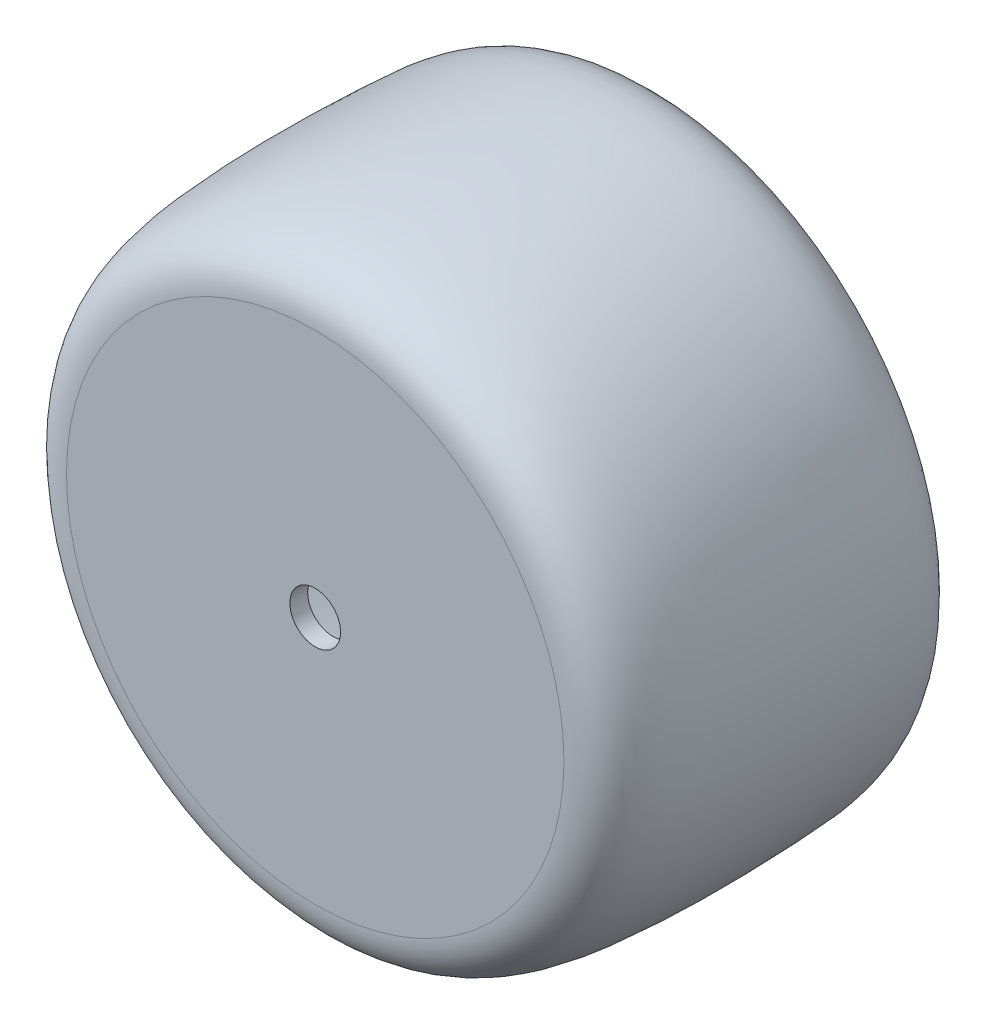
ISO-10303-21;
HEADER;
FILE_DESCRIPTION(('STEP AP214'),'2;1');
FILE_NAME('part.step','',(''),(''),'','','');
FILE_SCHEMA(('AUTOMOTIVE_DESIGN { 1 0 10303 214 1 1 1 1 }'));
ENDSEC;
DATA;
#1=APPLICATION_CONTEXT('core data for automotive mechanical design processes');
#2=APPLICATION_PROTOCOL_DEFINITION('international standard','automotive_design',2000,#1);
#3=PRODUCT_CONTEXT('',#1,'mechanical');
#4=PRODUCT('Part','Part','',(#3));
#5=PRODUCT_RELATED_PRODUCT_CATEGORY('part','',(#4));
#6=PRODUCT_DEFINITION_FORMATION('','',#4);
#7=PRODUCT_DEFINITION_CONTEXT('part definition',#1,'design');
#8=PRODUCT_DEFINITION('design','',#6,#7);
#9=PRODUCT_DEFINITION_SHAPE('','',#8);
#10=(LENGTH_UNIT() NAMED_UNIT(*) SI_UNIT(.MILLI.,.METRE.));
#11=(NAMED_UNIT(*) PLANE_ANGLE_UNIT() SI_UNIT($,.RADIAN.));
#12=(NAMED_UNIT(*) SI_UNIT($,.STERADIAN.) SOLID_ANGLE_UNIT());
#13=UNCERTAINTY_MEASURE_WITH_UNIT(LENGTH_MEASURE(1.E-05),#10,'distance_accuracy_value','');
#14=(GEOMETRIC_REPRESENTATION_CONTEXT(3) GLOBAL_UNCERTAINTY_ASSIGNED_CONTEXT((#13)) GLOBAL_UNIT_ASSIGNED_CONTEXT((#10,
#11,#12)) REPRESENTATION_CONTEXT('',''));
#15=CARTESIAN_POINT('',(0.,0.,0.));
#16=DIRECTION('',(0.,0.,1.));
#17=DIRECTION('',(1.,0.,0.));
#18=AXIS2_PLACEMENT_3D('',#15,#16,#17);
#19=CARTESIAN_POINT('',(-95.,-9.37611806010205E-13,516.903740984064));
#20=CARTESIAN_POINT('',(-95.,-9.37611806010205E-13,567.751629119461));
#21=CARTESIAN_POINT('',(-94.9999999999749,-10.0000000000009,516.903740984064));
#22=CARTESIAN_POINT('',(-94.9999999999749,-10.0000000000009,567.751629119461));
#23=CARTESIAN_POINT('',(-105.,-10.0000000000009,516.903740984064));
#24=CARTESIAN_POINT('',(-105.,-10.0000000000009,567.751629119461));
#25=CARTESIAN_POINT('',(-114.999999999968,-10.0000000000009,516.903740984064));
#26=CARTESIAN_POINT('',(-114.999999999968,-10.0000000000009,567.751629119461));
#27=CARTESIAN_POINT('',(-115.,-9.38836452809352E-13,516.903740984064));
#28=CARTESIAN_POINT('',(-115.,-9.38836452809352E-13,567.751629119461));
#29=CARTESIAN_POINT('',(-114.999999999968,9.99999999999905,516.903740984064));
#30=CARTESIAN_POINT('',(-114.999999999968,9.99999999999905,567.751629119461));
#31=CARTESIAN_POINT('',(-105.,9.99999999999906,516.903740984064));
#32=CARTESIAN_POINT('',(-105.,9.99999999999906,567.751629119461));
#33=CARTESIAN_POINT('',(-94.9999999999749,9.99999999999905,516.903740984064));
#34=CARTESIAN_POINT('',(-94.9999999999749,9.99999999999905,567.751629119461));
#35=CARTESIAN_POINT('',(-95.,-9.37611806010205E-13,516.903740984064));
#36=CARTESIAN_POINT('',(-95.,-9.37611806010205E-13,567.751629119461));
#37=(BOUNDED_SURFACE() B_SPLINE_SURFACE(2,1,((#19,#20),(#21,#22),(#23,#24),(#25,#26),(#27,#28),
(#29,#30),(#31,#32),(#33,#34),(#35,#36)),.UNSPECIFIED.,.T.,.F.,
.F.) B_SPLINE_SURFACE_WITH_KNOTS((3,2,2,2,3),(2,2),(0.,15.7079632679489,31.415926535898,
47.1238898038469,62.8318530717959),(0.,8.65537010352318),
.UNSPECIFIED.) GEOMETRIC_REPRESENTATION_ITEM() RATIONAL_B_SPLINE_SURFACE(((1.,1.),
(0.707106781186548,0.707106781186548),(1.,1.),(0.707106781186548,0.707106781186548),(1.,1.),
(0.707106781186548,0.707106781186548),(1.,1.),(0.707106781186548,0.707106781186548),(1.,1.))) REPRESENTATION_ITEM('') SURFACE());
#38=CARTESIAN_POINT('',(-115.,-9.37840606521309E-13,538.));
#39=CARTESIAN_POINT('',(-115.,9.99999999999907,538.));
#40=CARTESIAN_POINT('',(-105.,9.99999999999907,538.));
#41=CARTESIAN_POINT('',(-94.9999999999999,9.99999999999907,538.));
#42=CARTESIAN_POINT('',(-95.,-9.36158358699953E-13,538.));
#43=CARTESIAN_POINT('',(-94.9999999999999,-10.0000000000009,538.));
#44=CARTESIAN_POINT('',(-105.,-10.0000000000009,538.));
#45=CARTESIAN_POINT('',(-115.,-10.0000000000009,538.));
#46=CARTESIAN_POINT('',(-115.,-9.37840606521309E-13,538.));
#47=(BOUNDED_CURVE() B_SPLINE_CURVE(2,(#38,#39,#40,#41,#42,#43,#44,#45,#46),.UNSPECIFIED.,.T.,
.F.) B_SPLINE_CURVE_WITH_KNOTS((3,2,2,2,3),(0.,191.105053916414,382.210107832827,
573.31516174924,764.420215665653),
.UNSPECIFIED.) CURVE() GEOMETRIC_REPRESENTATION_ITEM() RATIONAL_B_SPLINE_CURVE((1.,
0.707106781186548,1.,0.707106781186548,1.,0.707106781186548,1.,0.707106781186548,1.)) REPRESENTATION_ITEM(''));
#48=CARTESIAN_POINT('',(-95.,-9.37127323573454E-13,538.));
#49=VERTEX_POINT('',#48);
#50=CARTESIAN_POINT('',(-115.,-8.28310601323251E-13,538.));
#51=VERTEX_POINT('',#50);
#52=EDGE_CURVE('E40',#49,#51,#47,.T.);
#53=CARTESIAN_POINT('',(-115.,-9.37840606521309E-13,538.));
#54=CARTESIAN_POINT('',(-115.,9.99999999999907,538.));
#55=CARTESIAN_POINT('',(-105.,9.99999999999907,538.));
#56=CARTESIAN_POINT('',(-94.9999999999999,9.99999999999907,538.));
#57=CARTESIAN_POINT('',(-95.,-9.36158358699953E-13,538.));
#58=CARTESIAN_POINT('',(-94.9999999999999,-10.0000000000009,538.));
#59=CARTESIAN_POINT('',(-105.,-10.0000000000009,538.));
#60=CARTESIAN_POINT('',(-115.,-10.0000000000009,538.));
#61=CARTESIAN_POINT('',(-115.,-9.37840606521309E-13,538.));
#62=(BOUNDED_CURVE() B_SPLINE_CURVE(2,(#53,#54,#55,#56,#57,#58,#59,#60,#61),.UNSPECIFIED.,.T.,
.F.) B_SPLINE_CURVE_WITH_KNOTS((3,2,2,2,3),(0.,191.105053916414,382.210107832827,
573.31516174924,764.420215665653),
.UNSPECIFIED.) CURVE() GEOMETRIC_REPRESENTATION_ITEM() RATIONAL_B_SPLINE_CURVE((1.,
0.707106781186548,1.,0.707106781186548,1.,0.707106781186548,1.,0.707106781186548,1.)) REPRESENTATION_ITEM(''));
#63=EDGE_CURVE('E61',#51,#49,#62,.T.);
#64=CARTESIAN_POINT('',(-115.,-9.35138232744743E-13,531.000032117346));
#65=CARTESIAN_POINT('',(-115.,-10.0000000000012,531.000032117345));
#66=CARTESIAN_POINT('',(-105.,-10.0000000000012,531.000032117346));
#67=CARTESIAN_POINT('',(-94.9999999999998,-10.0000000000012,531.000032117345));
#68=CARTESIAN_POINT('',(-94.9999999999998,-9.3886073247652E-13,531.000032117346));
#69=CARTESIAN_POINT('',(-94.9999999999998,9.99999999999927,531.000032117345));
#70=CARTESIAN_POINT('',(-105.,9.99999999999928,531.000032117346));
#71=CARTESIAN_POINT('',(-115.,9.99999999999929,531.000032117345));
#72=CARTESIAN_POINT('',(-115.,-9.35138232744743E-13,531.000032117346));
#73=(BOUNDED_CURVE() B_SPLINE_CURVE(2,(#64,#65,#66,#67,#68,#69,#70,#71,#72),.UNSPECIFIED.,.T.,
.F.) B_SPLINE_CURVE_WITH_KNOTS((3,2,2,2,3),(0.,191.105053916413,382.210107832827,
573.315161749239,764.420215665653),
.UNSPECIFIED.) CURVE() GEOMETRIC_REPRESENTATION_ITEM() RATIONAL_B_SPLINE_CURVE((1.,
0.707106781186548,1.,0.707106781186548,1.,0.707106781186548,1.,0.707106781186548,1.)) REPRESENTATION_ITEM(''));
#74=CARTESIAN_POINT('',(-95.,-9.3802811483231E-13,531.000032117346));
#75=VERTEX_POINT('',#74);
#76=CARTESIAN_POINT('',(-114.99999999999,-9.36370972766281E-13,531.000032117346));
#77=VERTEX_POINT('',#76);
#78=EDGE_CURVE('E48',#75,#77,#73,.T.);
#79=CARTESIAN_POINT('',(-114.999999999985,-9.35138232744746E-13,531.000032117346));
#80=CARTESIAN_POINT('',(-114.999999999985,-9.99999999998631,531.000032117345));
#81=CARTESIAN_POINT('',(-105.,-9.99999999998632,531.000032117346));
#82=CARTESIAN_POINT('',(-95.0000000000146,-9.99999999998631,531.000032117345));
#83=CARTESIAN_POINT('',(-95.0000000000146,-9.38860732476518E-13,531.000032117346));
#84=CARTESIAN_POINT('',(-95.0000000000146,9.99999999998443,531.000032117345));
#85=CARTESIAN_POINT('',(-105.,9.99999999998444,531.000032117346));
#86=CARTESIAN_POINT('',(-114.999999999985,9.99999999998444,531.000032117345));
#87=CARTESIAN_POINT('',(-114.999999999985,-9.35138232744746E-13,531.000032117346));
#88=(BOUNDED_CURVE() B_SPLINE_CURVE(2,(#79,#80,#81,#82,#83,#84,#85,#86,#87),.UNSPECIFIED.,.T.,
.F.) B_SPLINE_CURVE_WITH_KNOTS((3,2,2,2,3),(0.,191.105053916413,382.210107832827,
573.315161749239,764.420215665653),
.UNSPECIFIED.) CURVE() GEOMETRIC_REPRESENTATION_ITEM() RATIONAL_B_SPLINE_CURVE((1.,
0.707106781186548,1.,0.707106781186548,1.,0.707106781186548,1.,0.707106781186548,1.)) REPRESENTATION_ITEM(''));
#89=EDGE_CURVE('E51',#77,#75,#88,.T.);
#90=ORIENTED_EDGE('',*,*,#52,.F.);
#91=ORIENTED_EDGE('',*,*,#63,.F.);
#92=EDGE_LOOP('',(#90,#91));
#93=FACE_BOUND('',#92,.T.);
#94=ORIENTED_EDGE('',*,*,#78,.F.);
#95=ORIENTED_EDGE('',*,*,#89,.F.);
#96=EDGE_LOOP('',(#94,#95));
#97=FACE_BOUND('',#96,.T.);
#98=ADVANCED_FACE('F18',(#93,#97),#37,.T.);
#99=CARTESIAN_POINT('',(-114.999999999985,-9.35138232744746E-13,531.000032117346));
#100=CARTESIAN_POINT('',(-114.999999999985,9.99999999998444,531.000032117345));
#101=CARTESIAN_POINT('',(-105.,9.99999999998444,531.000032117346));
#102=CARTESIAN_POINT('',(-95.0000000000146,9.99999999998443,531.000032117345));
#103=CARTESIAN_POINT('',(-95.0000000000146,-9.38860732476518E-13,531.000032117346));
#104=CARTESIAN_POINT('',(-95.0000000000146,-9.99999999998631,531.000032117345));
#105=CARTESIAN_POINT('',(-105.,-9.99999999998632,531.000032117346));
#106=CARTESIAN_POINT('',(-114.999999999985,-9.99999999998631,531.000032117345));
#107=CARTESIAN_POINT('',(-114.999999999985,-9.35138232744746E-13,531.000032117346));
#108=CARTESIAN_POINT('',(-144.232099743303,-9.28978880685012E-13,531.000126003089));
#109=CARTESIAN_POINT('',(-144.232099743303,39.2320997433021,531.000126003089));
#110=CARTESIAN_POINT('',(-105.,39.2320997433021,531.000126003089));
#111=CARTESIAN_POINT('',(-65.7679002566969,39.2320997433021,531.000126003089));
#112=CARTESIAN_POINT('',(-65.7679002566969,-9.4144018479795E-13,531.000126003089));
#113=CARTESIAN_POINT('',(-65.7679002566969,-39.232099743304,531.000126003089));
#114=CARTESIAN_POINT('',(-105.,-39.232099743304,531.000126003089));
#115=CARTESIAN_POINT('',(-144.232099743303,-39.232099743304,531.000126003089));
#116=CARTESIAN_POINT('',(-144.232099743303,-9.28978880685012E-13,531.000126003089));
#117=CARTESIAN_POINT('',(-173.46419948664,-9.31871440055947E-13,531.000219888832));
#118=CARTESIAN_POINT('',(-173.464199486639,68.4641994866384,531.000219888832));
#119=CARTESIAN_POINT('',(-105.,68.4641994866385,531.000219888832));
#120=CARTESIAN_POINT('',(-36.5358005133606,68.4641994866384,531.000219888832));
#121=CARTESIAN_POINT('',(-36.5358005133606,-9.34967725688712E-13,531.000219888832));
#122=CARTESIAN_POINT('',(-36.5358005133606,-68.4641994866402,531.000219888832));
#123=CARTESIAN_POINT('',(-105.,-68.4641994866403,531.000219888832));
#124=CARTESIAN_POINT('',(-173.464199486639,-68.4641994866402,531.000219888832));
#125=CARTESIAN_POINT('',(-173.46419948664,-9.31871440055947E-13,531.000219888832));
#126=CARTESIAN_POINT('',(-202.696299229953,-9.34763999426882E-13,531.000313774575));
#127=CARTESIAN_POINT('',(-202.696299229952,97.6962992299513,531.000313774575));
#128=CARTESIAN_POINT('',(-105.,97.6962992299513,531.000313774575));
#129=CARTESIAN_POINT('',(-7.30370077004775,97.6962992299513,531.000313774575));
#130=CARTESIAN_POINT('',(-7.30370077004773,-9.28495266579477E-13,531.000313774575));
#131=CARTESIAN_POINT('',(-7.30370077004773,-97.6962992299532,531.000313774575));
#132=CARTESIAN_POINT('',(-105.,-97.6962992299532,531.000313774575));
#133=CARTESIAN_POINT('',(-202.696299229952,-97.6962992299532,531.000313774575));
#134=CARTESIAN_POINT('',(-202.696299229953,-9.34763999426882E-13,531.000313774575));
#135=(BOUNDED_SURFACE() B_SPLINE_SURFACE(3,2,((#99,#100,#101,#102,#103,#104,#105,#106,#107),
(#108,#109,#110,#111,#112,#113,#114,#115,#116),(#117,#118,#119,#120,#121,#122,#123,#124,#125),
(#126,#127,#128,#129,#130,#131,#132,#133,#134)),.UNSPECIFIED.,.F.,.T.,
.F.) B_SPLINE_SURFACE_WITH_KNOTS((4,4),(3,2,2,2,3),(-499.545143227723,-328.174876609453),(0.,
191.105053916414,382.210107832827,573.31516174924,764.420215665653),
.UNSPECIFIED.) GEOMETRIC_REPRESENTATION_ITEM() RATIONAL_B_SPLINE_SURFACE(((1.,0.707106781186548,
1.,0.707106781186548,1.,0.707106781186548,1.,0.707106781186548,1.),(1.,0.707106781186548,1.,
0.707106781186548,1.,0.707106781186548,1.,0.707106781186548,1.),(1.,0.707106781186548,1.,
0.707106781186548,1.,0.707106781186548,1.,0.707106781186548,1.),(1.,0.707106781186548,1.,
0.707106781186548,1.,0.707106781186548,1.,0.707106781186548,1.))) REPRESENTATION_ITEM('') SURFACE());
#136=CARTESIAN_POINT('',(-202.696299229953,-9.34763999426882E-13,531.000313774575));
#137=CARTESIAN_POINT('',(-202.696299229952,97.6962992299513,531.000313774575));
#138=CARTESIAN_POINT('',(-105.,97.6962992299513,531.000313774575));
#139=CARTESIAN_POINT('',(-7.30370077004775,97.6962992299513,531.000313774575));
#140=CARTESIAN_POINT('',(-7.30370077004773,-9.28495266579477E-13,531.000313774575));
#141=CARTESIAN_POINT('',(-7.30370077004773,-97.6962992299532,531.000313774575));
#142=CARTESIAN_POINT('',(-105.,-97.6962992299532,531.000313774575));
#143=CARTESIAN_POINT('',(-202.696299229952,-97.6962992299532,531.000313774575));
#144=CARTESIAN_POINT('',(-202.696299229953,-9.34763999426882E-13,531.000313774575));
#145=(BOUNDED_CURVE() B_SPLINE_CURVE(2,(#136,#137,#138,#139,#140,#141,#142,#143,#144),
.UNSPECIFIED.,.T.,.F.) B_SPLINE_CURVE_WITH_KNOTS((3,2,2,2,3),(0.,191.105053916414,
382.210107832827,573.31516174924,764.420215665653),
.UNSPECIFIED.) CURVE() GEOMETRIC_REPRESENTATION_ITEM() RATIONAL_B_SPLINE_CURVE((1.,
0.707106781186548,1.,0.707106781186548,1.,0.707106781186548,1.,0.707106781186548,1.)) REPRESENTATION_ITEM(''));
#146=CARTESIAN_POINT('',(-202.696299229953,-9.34763999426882E-13,531.000313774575));
#147=VERTEX_POINT('',#146);
#148=EDGE_CURVE('E11',#147,#147,#145,.T.);
#149=ORIENTED_EDGE('',*,*,#148,.T.);
#150=EDGE_LOOP('',(#149));
#151=FACE_BOUND('',#150,.T.);
#152=ORIENTED_EDGE('',*,*,#78,.T.);
#153=ORIENTED_EDGE('',*,*,#89,.T.);
#154=EDGE_LOOP('',(#152,#153));
#155=FACE_BOUND('',#154,.T.);
#156=ADVANCED_FACE('F59',(#151,#155),#135,.T.);
#157=CARTESIAN_POINT('',(-202.762577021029,-9.39848618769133E-13,538.));
#158=CARTESIAN_POINT('',(-202.762577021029,97.7625770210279,538.));
#159=CARTESIAN_POINT('',(-105.,97.7625770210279,538.));
#160=CARTESIAN_POINT('',(-7.23742297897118,97.7625770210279,538.));
#161=CARTESIAN_POINT('',(-7.23742297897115,-9.23402530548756E-13,538.));
#162=CARTESIAN_POINT('',(-7.23742297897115,-97.7625770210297,538.));
#163=CARTESIAN_POINT('',(-105.,-97.7625770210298,538.));
#164=CARTESIAN_POINT('',(-202.762577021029,-97.7625770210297,538.));
#165=CARTESIAN_POINT('',(-202.762577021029,-9.39848618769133E-13,538.));
#166=CARTESIAN_POINT('',(-173.508384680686,-9.39179281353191E-13,538.));
#167=CARTESIAN_POINT('',(-173.508384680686,68.5083846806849,538.));
#168=CARTESIAN_POINT('',(-105.,68.508384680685,538.));
#169=CARTESIAN_POINT('',(-36.4916153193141,68.5083846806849,538.));
#170=CARTESIAN_POINT('',(-36.4916153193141,-9.27654473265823E-13,538.));
#171=CARTESIAN_POINT('',(-36.4916153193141,-68.5083846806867,538.));
#172=CARTESIAN_POINT('',(-105.,-68.5083846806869,538.));
#173=CARTESIAN_POINT('',(-173.508384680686,-68.5083846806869,538.));
#174=CARTESIAN_POINT('',(-173.508384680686,-9.39179281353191E-13,538.));
#175=CARTESIAN_POINT('',(-144.254192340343,-9.38509943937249E-13,538.));
#176=CARTESIAN_POINT('',(-144.254192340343,39.254192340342,538.));
#177=CARTESIAN_POINT('',(-105.,39.254192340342,538.));
#178=CARTESIAN_POINT('',(-65.7458076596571,39.254192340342,538.));
#179=CARTESIAN_POINT('',(-65.7458076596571,-9.31906415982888E-13,538.));
#180=CARTESIAN_POINT('',(-65.7458076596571,-39.2541923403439,538.));
#181=CARTESIAN_POINT('',(-105.,-39.2541923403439,538.));
#182=CARTESIAN_POINT('',(-144.254192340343,-39.2541923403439,538.));
#183=CARTESIAN_POINT('',(-144.254192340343,-9.38509943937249E-13,538.));
#184=CARTESIAN_POINT('',(-115.,-9.37840606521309E-13,538.));
#185=CARTESIAN_POINT('',(-115.,9.99999999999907,538.));
#186=CARTESIAN_POINT('',(-105.,9.99999999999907,538.));
#187=CARTESIAN_POINT('',(-94.9999999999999,9.99999999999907,538.));
#188=CARTESIAN_POINT('',(-95.,-9.36158358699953E-13,538.));
#189=CARTESIAN_POINT('',(-94.9999999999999,-10.0000000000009,538.));
#190=CARTESIAN_POINT('',(-105.,-10.0000000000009,538.));
#191=CARTESIAN_POINT('',(-115.,-10.0000000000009,538.));
#192=CARTESIAN_POINT('',(-115.,-9.37840606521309E-13,538.));
#193=(BOUNDED_SURFACE() B_SPLINE_SURFACE(3,2,((#157,#158,#159,#160,#161,#162,#163,#164,#165),
(#166,#167,#168,#169,#170,#171,#172,#173,#174),(#175,#176,#177,#178,#179,#180,#181,#182,#183),
(#184,#185,#186,#187,#188,#189,#190,#191,#192)),.UNSPECIFIED.,.F.,.T.,
.F.) B_SPLINE_SURFACE_WITH_KNOTS((4,4),(3,2,2,2,3),(-183.788922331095,-12.4054077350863),(0.,
191.105053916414,382.210107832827,573.31516174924,764.420215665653),
.UNSPECIFIED.) GEOMETRIC_REPRESENTATION_ITEM() RATIONAL_B_SPLINE_SURFACE(((1.,0.707106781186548,
1.,0.707106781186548,1.,0.707106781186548,1.,0.707106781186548,1.),(1.,0.707106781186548,1.,
0.707106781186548,1.,0.707106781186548,1.,0.707106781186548,1.),(1.,0.707106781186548,1.,
0.707106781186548,1.,0.707106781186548,1.,0.707106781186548,1.),(1.,0.707106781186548,1.,
0.707106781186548,1.,0.707106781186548,1.,0.707106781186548,1.))) REPRESENTATION_ITEM('') SURFACE());
#194=CARTESIAN_POINT('',(-202.762577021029,-9.39848618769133E-13,538.));
#195=CARTESIAN_POINT('',(-202.762577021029,97.7625770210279,538.));
#196=CARTESIAN_POINT('',(-105.,97.7625770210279,538.));
#197=CARTESIAN_POINT('',(-7.23742297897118,97.7625770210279,538.));
#198=CARTESIAN_POINT('',(-7.23742297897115,-9.23402530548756E-13,538.));
#199=CARTESIAN_POINT('',(-7.23742297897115,-97.7625770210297,538.));
#200=CARTESIAN_POINT('',(-105.,-97.7625770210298,538.));
#201=CARTESIAN_POINT('',(-202.762577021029,-97.7625770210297,538.));
#202=CARTESIAN_POINT('',(-202.762577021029,-9.39848618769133E-13,538.));
#203=(BOUNDED_CURVE() B_SPLINE_CURVE(2,(#194,#195,#196,#197,#198,#199,#200,#201,#202),
.UNSPECIFIED.,.T.,.F.) B_SPLINE_CURVE_WITH_KNOTS((3,2,2,2,3),(0.,191.105053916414,
382.210107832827,573.31516174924,764.420215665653),
.UNSPECIFIED.) CURVE() GEOMETRIC_REPRESENTATION_ITEM() RATIONAL_B_SPLINE_CURVE((1.,
0.707106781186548,1.,0.707106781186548,1.,0.707106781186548,1.,0.707106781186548,1.)) REPRESENTATION_ITEM(''));
#204=CARTESIAN_POINT('',(-202.762577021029,-9.39848618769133E-13,538.));
#205=VERTEX_POINT('',#204);
#206=EDGE_CURVE('E32',#205,#205,#203,.T.);
#207=ORIENTED_EDGE('',*,*,#52,.T.);
#208=ORIENTED_EDGE('',*,*,#63,.T.);
#209=EDGE_LOOP('',(#207,#208));
#210=FACE_BOUND('',#209,.T.);
#211=ORIENTED_EDGE('',*,*,#206,.F.);
#212=EDGE_LOOP('',(#211));
#213=FACE_BOUND('',#212,.T.);
#214=ADVANCED_FACE('F81',(#210,#213),#193,.T.);
#215=CARTESIAN_POINT('',(-202.696299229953,-9.34763999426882E-13,531.000313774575));
#216=CARTESIAN_POINT('',(-202.696299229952,97.6962992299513,531.000313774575));
#217=CARTESIAN_POINT('',(-105.,97.6962992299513,531.000313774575));
#218=CARTESIAN_POINT('',(-7.30370077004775,97.6962992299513,531.000313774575));
#219=CARTESIAN_POINT('',(-7.30370077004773,-9.28495266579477E-13,531.000313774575));
#220=CARTESIAN_POINT('',(-7.30370077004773,-97.6962992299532,531.000313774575));
#221=CARTESIAN_POINT('',(-105.,-97.6962992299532,531.000313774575));
#222=CARTESIAN_POINT('',(-202.696299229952,-97.6962992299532,531.000313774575));
#223=CARTESIAN_POINT('',(-202.696299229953,-9.34763999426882E-13,531.000313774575));
#224=CARTESIAN_POINT('',(-209.67450409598,-8.07855926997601E-13,531.11984691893));
#225=CARTESIAN_POINT('',(-209.674504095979,104.674504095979,531.11984691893));
#226=CARTESIAN_POINT('',(-105.,104.674504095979,531.11984691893));
#227=CARTESIAN_POINT('',(-0.3254959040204,104.674504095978,531.11984691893));
#228=CARTESIAN_POINT('',(-0.325495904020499,-1.05454875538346E-12,531.11984691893));
#229=CARTESIAN_POINT('',(-0.325495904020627,-104.67450409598,531.11984691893));
#230=CARTESIAN_POINT('',(-105.,-104.67450409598,531.11984691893));
#231=CARTESIAN_POINT('',(-209.674504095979,-104.67450409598,531.11984691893));
#232=CARTESIAN_POINT('',(-209.67450409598,-8.07855926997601E-13,531.11984691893));
#233=CARTESIAN_POINT('',(-215.842457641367,1.09129879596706E-13,521.418533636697));
#234=CARTESIAN_POINT('',(-215.842457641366,110.842457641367,521.418533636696));
#235=CARTESIAN_POINT('',(-105.,110.842457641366,521.418533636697));
#236=CARTESIAN_POINT('',(5.84245764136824,110.842457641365,521.418533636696));
#237=CARTESIAN_POINT('',(5.84245764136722,-1.9707792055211E-12,521.418533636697));
#238=CARTESIAN_POINT('',(5.84245764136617,-110.842457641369,521.418533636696));
#239=CARTESIAN_POINT('',(-105.,-110.842457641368,521.418533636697));
#240=CARTESIAN_POINT('',(-215.842457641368,-110.842457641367,521.418533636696));
#241=CARTESIAN_POINT('',(-215.842457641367,1.09129879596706E-13,521.418533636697));
#242=CARTESIAN_POINT('',(-218.939659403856,-9.20267986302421E-13,498.464920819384));
#243=CARTESIAN_POINT('',(-218.939659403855,113.939659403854,498.464920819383));
#244=CARTESIAN_POINT('',(-105.,113.939659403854,498.464920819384));
#245=CARTESIAN_POINT('',(8.93965940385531,113.939659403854,498.464920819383));
#246=CARTESIAN_POINT('',(8.93965940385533,-9.41002041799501E-13,498.464920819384));
#247=CARTESIAN_POINT('',(8.93965940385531,-113.939659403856,498.464920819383));
#248=CARTESIAN_POINT('',(-105.,-113.939659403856,498.464920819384));
#249=CARTESIAN_POINT('',(-218.939659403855,-113.939659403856,498.464920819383));
#250=CARTESIAN_POINT('',(-218.939659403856,-9.20267986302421E-13,498.464920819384));
#251=CARTESIAN_POINT('',(-219.768596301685,5.06427626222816E-13,475.859894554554));
#252=CARTESIAN_POINT('',(-219.768596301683,114.768596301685,475.859894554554));
#253=CARTESIAN_POINT('',(-104.999999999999,114.768596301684,475.859894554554));
#254=CARTESIAN_POINT('',(9.76859630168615,114.768596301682,475.859894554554));
#255=CARTESIAN_POINT('',(9.76859630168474,-2.36759613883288E-12,475.859894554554));
#256=CARTESIAN_POINT('',(9.76859630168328,-114.768596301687,475.859894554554));
#257=CARTESIAN_POINT('',(-105.000000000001,-114.768596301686,475.859894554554));
#258=CARTESIAN_POINT('',(-219.768596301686,-114.768596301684,475.859894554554));
#259=CARTESIAN_POINT('',(-219.768596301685,5.06427626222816E-13,475.859894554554));
#260=CARTESIAN_POINT('',(-219.724028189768,-1.54692235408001E-12,453.02451690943));
#261=CARTESIAN_POINT('',(-219.724028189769,114.724028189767,453.024516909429));
#262=CARTESIAN_POINT('',(-105.,114.724028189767,453.02451690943));
#263=CARTESIAN_POINT('',(9.72402818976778,114.724028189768,453.024516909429));
#264=CARTESIAN_POINT('',(9.72402818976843,-3.14251616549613E-13,453.02451690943));
#265=CARTESIAN_POINT('',(9.72402818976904,-114.724028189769,453.024516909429));
#266=CARTESIAN_POINT('',(-105.,-114.724028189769,453.02451690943));
#267=CARTESIAN_POINT('',(-219.724028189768,-114.72402818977,453.024516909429));
#268=CARTESIAN_POINT('',(-219.724028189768,-1.54692235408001E-12,453.02451690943));
#269=CARTESIAN_POINT('',(-219.046889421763,-7.8437757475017E-13,437.097337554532));
#270=CARTESIAN_POINT('',(-219.046889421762,114.046889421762,437.097337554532));
#271=CARTESIAN_POINT('',(-105.,114.046889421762,437.097337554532));
#272=CARTESIAN_POINT('',(9.04688942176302,114.046889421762,437.097337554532));
#273=CARTESIAN_POINT('',(9.0468894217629,-1.07687932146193E-12,437.097337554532));
#274=CARTESIAN_POINT('',(9.04688942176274,-114.046889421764,437.097337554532));
#275=CARTESIAN_POINT('',(-105.,-114.046889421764,437.097337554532));
#276=CARTESIAN_POINT('',(-219.046889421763,-114.046889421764,437.097337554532));
#277=CARTESIAN_POINT('',(-219.046889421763,-7.8437757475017E-13,437.097337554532));
#278=CARTESIAN_POINT('',(-218.63151717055,-1.55975047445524E-12,415.788249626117));
#279=CARTESIAN_POINT('',(-218.631517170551,113.631517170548,415.788249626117));
#280=CARTESIAN_POINT('',(-105.,113.631517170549,415.788249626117));
#281=CARTESIAN_POINT('',(8.6315171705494,113.63151717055,415.788249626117));
#282=CARTESIAN_POINT('',(8.63151717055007,-3.01557290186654E-13,415.788249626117));
#283=CARTESIAN_POINT('',(8.63151717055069,-113.63151717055,415.788249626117));
#284=CARTESIAN_POINT('',(-105.,-113.631517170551,415.788249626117));
#285=CARTESIAN_POINT('',(-218.631517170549,-113.631517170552,415.788249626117));
#286=CARTESIAN_POINT('',(-218.63151717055,-1.55975047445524E-12,415.788249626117));
#287=CARTESIAN_POINT('',(-213.353672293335,-1.19591363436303E-12,409.652207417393));
#288=CARTESIAN_POINT('',(-213.353672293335,108.353672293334,409.652207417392));
#289=CARTESIAN_POINT('',(-105.,108.353672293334,409.652207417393));
#290=CARTESIAN_POINT('',(3.35367229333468,108.353672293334,409.652207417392));
#291=CARTESIAN_POINT('',(3.35367229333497,-6.66040479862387E-13,409.652207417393));
#292=CARTESIAN_POINT('',(3.35367229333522,-108.353672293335,409.652207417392));
#293=CARTESIAN_POINT('',(-105.,-108.353672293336,409.652207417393));
#294=CARTESIAN_POINT('',(-213.353672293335,-108.353672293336,409.652207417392));
#295=CARTESIAN_POINT('',(-213.353672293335,-1.19591363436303E-12,409.652207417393));
#296=CARTESIAN_POINT('',(-207.173456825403,-9.72202383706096E-13,409.242963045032));
#297=CARTESIAN_POINT('',(-207.173456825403,102.173456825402,409.242963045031));
#298=CARTESIAN_POINT('',(-105.,102.173456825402,409.242963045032));
#299=CARTESIAN_POINT('',(-2.82654317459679,102.173456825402,409.242963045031));
#300=CARTESIAN_POINT('',(-2.82654317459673,-8.90508588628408E-13,409.242963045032));
#301=CARTESIAN_POINT('',(-2.82654317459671,-102.173456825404,409.242963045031));
#302=CARTESIAN_POINT('',(-105.,-102.173456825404,409.242963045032));
#303=CARTESIAN_POINT('',(-207.173456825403,-102.173456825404,409.242963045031));
#304=CARTESIAN_POINT('',(-207.173456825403,-9.72202383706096E-13,409.242963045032));
#305=CARTESIAN_POINT('',(-206.296171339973,-9.54783542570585E-13,409.184870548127));
#306=CARTESIAN_POINT('',(-206.296171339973,101.296171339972,409.184870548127));
#307=CARTESIAN_POINT('',(-105.,101.296171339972,409.184870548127));
#308=CARTESIAN_POINT('',(-3.70382866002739,101.296171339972,409.184870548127));
#309=CARTESIAN_POINT('',(-3.70382866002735,-9.08034866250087E-13,409.184870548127));
#310=CARTESIAN_POINT('',(-3.70382866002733,-101.296171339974,409.184870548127));
#311=CARTESIAN_POINT('',(-105.,-101.296171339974,409.184870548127));
#312=CARTESIAN_POINT('',(-206.296171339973,-101.296171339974,409.184870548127));
#313=CARTESIAN_POINT('',(-206.296171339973,-9.54783542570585E-13,409.184870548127));
#314=CARTESIAN_POINT('',(-205.614128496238,-9.40285578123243E-13,408.630053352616));
#315=CARTESIAN_POINT('',(-205.614128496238,100.614128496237,408.630053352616));
#316=CARTESIAN_POINT('',(-105.,100.614128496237,408.630053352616));
#317=CARTESIAN_POINT('',(-4.38587150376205,100.614128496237,408.630053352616));
#318=CARTESIAN_POINT('',(-4.38587150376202,-9.22616356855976E-13,408.630053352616));
#319=CARTESIAN_POINT('',(-4.38587150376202,-100.614128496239,408.630053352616));
#320=CARTESIAN_POINT('',(-105.,-100.614128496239,408.630053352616));
#321=CARTESIAN_POINT('',(-205.614128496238,-100.614128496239,408.630053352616));
#322=CARTESIAN_POINT('',(-205.614128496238,-9.40285578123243E-13,408.630053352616));
#323=CARTESIAN_POINT('',(-205.378663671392,-9.34051045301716E-13,407.782963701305));
#324=CARTESIAN_POINT('',(-205.378663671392,100.378663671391,407.782963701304));
#325=CARTESIAN_POINT('',(-105.,100.378663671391,407.782963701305));
#326=CARTESIAN_POINT('',(-4.62133632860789,100.378663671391,407.782963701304));
#327=CARTESIAN_POINT('',(-4.62133632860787,-9.28879725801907E-13,407.782963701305));
#328=CARTESIAN_POINT('',(-4.62133632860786,-100.378663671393,407.782963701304));
#329=CARTESIAN_POINT('',(-105.,-100.378663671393,407.782963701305));
#330=CARTESIAN_POINT('',(-205.378663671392,-100.378663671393,407.782963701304));
#331=CARTESIAN_POINT('',(-205.378663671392,-9.34051045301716E-13,407.782963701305));
#332=CARTESIAN_POINT('',(-205.190243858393,-9.36249822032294E-13,407.105119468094));
#333=CARTESIAN_POINT('',(-205.190243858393,100.190243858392,407.105119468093));
#334=CARTESIAN_POINT('',(-105.,100.190243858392,407.105119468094));
#335=CARTESIAN_POINT('',(-4.80975614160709,100.190243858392,407.105119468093));
#336=CARTESIAN_POINT('',(-4.80975614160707,-9.26704023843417E-13,407.105119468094));
#337=CARTESIAN_POINT('',(-4.80975614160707,-100.190243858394,407.105119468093));
#338=CARTESIAN_POINT('',(-105.,-100.190243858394,407.105119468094));
#339=CARTESIAN_POINT('',(-205.190243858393,-100.190243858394,407.105119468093));
#340=CARTESIAN_POINT('',(-205.190243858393,-9.36249822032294E-13,407.105119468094));
#341=CARTESIAN_POINT('',(-204.997664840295,-9.38936732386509E-13,405.653191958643));
#342=CARTESIAN_POINT('',(-204.997664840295,99.9976648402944,405.653191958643));
#343=CARTESIAN_POINT('',(-105.,99.9976648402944,405.653191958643));
#344=CARTESIAN_POINT('',(-5.0023351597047,99.9976648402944,405.653191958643));
#345=CARTESIAN_POINT('',(-5.00233515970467,-9.24040697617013E-13,405.653191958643));
#346=CARTESIAN_POINT('',(-5.00233515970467,-99.9976648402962,405.653191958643));
#347=CARTESIAN_POINT('',(-105.,-99.9976648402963,405.653191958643));
#348=CARTESIAN_POINT('',(-204.997664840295,-99.9976648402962,405.653191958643));
#349=CARTESIAN_POINT('',(-204.997664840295,-9.38936732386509E-13,405.653191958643));
#350=CARTESIAN_POINT('',(-205.355264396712,-9.36333341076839E-13,404.229127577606));
#351=CARTESIAN_POINT('',(-205.355264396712,100.355264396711,404.229127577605));
#352=CARTESIAN_POINT('',(-105.,100.355264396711,404.229127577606));
#353=CARTESIAN_POINT('',(-4.64473560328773,100.355264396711,404.229127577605));
#354=CARTESIAN_POINT('',(-4.6447356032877,-9.26600295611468E-13,404.229127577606));
#355=CARTESIAN_POINT('',(-4.6447356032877,-100.355264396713,404.229127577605));
#356=CARTESIAN_POINT('',(-105.,-100.355264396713,404.229127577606));
#357=CARTESIAN_POINT('',(-205.355264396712,-100.355264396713,404.229127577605));
#358=CARTESIAN_POINT('',(-205.355264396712,-9.36333341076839E-13,404.229127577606));
#359=CARTESIAN_POINT('',(-205.640392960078,-9.33999610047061E-13,403.539091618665));
#360=CARTESIAN_POINT('',(-205.640392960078,100.640392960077,403.539091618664));
#361=CARTESIAN_POINT('',(-105.,100.640392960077,403.539091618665));
#362=CARTESIAN_POINT('',(-4.35960703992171,100.640392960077,403.539091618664));
#363=CARTESIAN_POINT('',(-4.35960703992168,-9.28899108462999E-13,403.539091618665));
#364=CARTESIAN_POINT('',(-4.35960703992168,-100.640392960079,403.539091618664));
#365=CARTESIAN_POINT('',(-105.,-100.640392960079,403.539091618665));
#366=CARTESIAN_POINT('',(-205.640392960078,-100.640392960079,403.539091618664));
#367=CARTESIAN_POINT('',(-205.640392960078,-9.33999610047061E-13,403.539091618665));
#368=CARTESIAN_POINT('',(-205.988777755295,-9.3046179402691E-13,402.69597006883));
#369=CARTESIAN_POINT('',(-205.988777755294,100.988777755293,402.69597006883));
#370=CARTESIAN_POINT('',(-105.,100.988777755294,402.69597006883));
#371=CARTESIAN_POINT('',(-4.01122224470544,100.988777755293,402.69597006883));
#372=CARTESIAN_POINT('',(-4.01122224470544,-9.32394259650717E-13,402.69597006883));
#373=CARTESIAN_POINT('',(-4.01122224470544,-100.988777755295,402.69597006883));
#374=CARTESIAN_POINT('',(-105.,-100.988777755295,402.69597006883));
#375=CARTESIAN_POINT('',(-205.988777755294,-100.988777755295,402.69597006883));
#376=CARTESIAN_POINT('',(-205.988777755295,-9.3046179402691E-13,402.69597006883));
#377=CARTESIAN_POINT('',(-206.770296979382,-9.28162889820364E-13,402.225381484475));
#378=CARTESIAN_POINT('',(-206.770296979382,101.770296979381,402.225381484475));
#379=CARTESIAN_POINT('',(-105.,101.770296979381,402.225381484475));
#380=CARTESIAN_POINT('',(-3.22970302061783,101.770296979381,402.225381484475));
#381=CARTESIAN_POINT('',(-3.22970302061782,-9.34597455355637E-13,402.225381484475));
#382=CARTESIAN_POINT('',(-3.22970302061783,-101.770296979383,402.225381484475));
#383=CARTESIAN_POINT('',(-105.,-101.770296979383,402.225381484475));
#384=CARTESIAN_POINT('',(-206.770296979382,-101.770296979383,402.225381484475));
#385=CARTESIAN_POINT('',(-206.770296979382,-9.28162889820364E-13,402.225381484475));
#386=CARTESIAN_POINT('',(-207.678450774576,-9.28004492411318E-13,402.3118834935));
#387=CARTESIAN_POINT('',(-207.678450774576,102.678450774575,402.3118834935));
#388=CARTESIAN_POINT('',(-105.,102.678450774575,402.3118834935));
#389=CARTESIAN_POINT('',(-2.32154922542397,102.678450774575,402.3118834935));
#390=CARTESIAN_POINT('',(-2.32154922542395,-9.34644636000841E-13,402.3118834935));
#391=CARTESIAN_POINT('',(-2.32154922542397,-102.678450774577,402.3118834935));
#392=CARTESIAN_POINT('',(-105.,-102.678450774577,402.3118834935));
#393=CARTESIAN_POINT('',(-207.678450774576,-102.678450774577,402.3118834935));
#394=CARTESIAN_POINT('',(-207.678450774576,-9.28004492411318E-13,402.3118834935));
#395=CARTESIAN_POINT('',(-223.962146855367,-9.27903389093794E-13,403.862912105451));
#396=CARTESIAN_POINT('',(-223.962146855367,118.962146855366,403.86291210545));
#397=CARTESIAN_POINT('',(-105.,118.962146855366,403.862912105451));
#398=CARTESIAN_POINT('',(13.9621468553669,118.962146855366,403.86291210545));
#399=CARTESIAN_POINT('',(13.9621468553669,-9.32751561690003E-13,403.862912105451));
#400=CARTESIAN_POINT('',(13.9621468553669,-118.962146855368,403.86291210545));
#401=CARTESIAN_POINT('',(-105.,-118.962146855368,403.862912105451));
#402=CARTESIAN_POINT('',(-223.962146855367,-118.962146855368,403.86291210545));
#403=CARTESIAN_POINT('',(-223.962146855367,-9.27903389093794E-13,403.862912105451));
#404=CARTESIAN_POINT('',(-226.477466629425,-9.39848618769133E-13,426.688938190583));
#405=CARTESIAN_POINT('',(-226.477466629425,121.477466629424,426.688938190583));
#406=CARTESIAN_POINT('',(-105.,121.477466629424,426.688938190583));
#407=CARTESIAN_POINT('',(16.4774666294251,121.477466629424,426.688938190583));
#408=CARTESIAN_POINT('',(16.4774666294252,-9.20498294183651E-13,426.688938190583));
#409=CARTESIAN_POINT('',(16.4774666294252,-121.477466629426,426.688938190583));
#410=CARTESIAN_POINT('',(-105.,-121.477466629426,426.688938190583));
#411=CARTESIAN_POINT('',(-226.477466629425,-121.477466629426,426.688938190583));
#412=CARTESIAN_POINT('',(-226.477466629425,-9.39848618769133E-13,426.688938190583));
#413=CARTESIAN_POINT('',(-227.662341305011,-9.39848618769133E-13,516.455446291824));
#414=CARTESIAN_POINT('',(-227.662341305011,122.66234130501,516.455446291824));
#415=CARTESIAN_POINT('',(-105.,122.66234130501,516.455446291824));
#416=CARTESIAN_POINT('',(17.662341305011,122.66234130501,516.455446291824));
#417=CARTESIAN_POINT('',(17.6623413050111,-9.20353188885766E-13,516.455446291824));
#418=CARTESIAN_POINT('',(17.6623413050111,-122.662341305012,516.455446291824));
#419=CARTESIAN_POINT('',(-105.,-122.662341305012,516.455446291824));
#420=CARTESIAN_POINT('',(-227.662341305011,-122.662341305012,516.455446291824));
#421=CARTESIAN_POINT('',(-227.662341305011,-9.39848618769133E-13,516.455446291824));
#422=CARTESIAN_POINT('',(-216.721120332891,-9.39848618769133E-13,537.86783101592));
#423=CARTESIAN_POINT('',(-216.721120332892,111.721120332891,537.86783101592));
#424=CARTESIAN_POINT('',(-105.,111.721120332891,537.86783101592));
#425=CARTESIAN_POINT('',(6.72112033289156,111.721120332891,537.86783101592));
#426=CARTESIAN_POINT('',(6.72112033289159,-9.21693102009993E-13,537.86783101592));
#427=CARTESIAN_POINT('',(6.72112033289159,-111.721120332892,537.86783101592));
#428=CARTESIAN_POINT('',(-105.,-111.721120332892,537.86783101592));
#429=CARTESIAN_POINT('',(-216.721120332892,-111.721120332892,537.86783101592));
#430=CARTESIAN_POINT('',(-216.721120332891,-9.39848618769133E-13,537.86783101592));
#431=CARTESIAN_POINT('',(-202.762577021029,-9.39848618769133E-13,538.));
#432=CARTESIAN_POINT('',(-202.762577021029,97.7625770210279,538.));
#433=CARTESIAN_POINT('',(-105.,97.7625770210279,538.));
#434=CARTESIAN_POINT('',(-7.23742297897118,97.7625770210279,538.));
#435=CARTESIAN_POINT('',(-7.23742297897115,-9.23402530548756E-13,538.));
#436=CARTESIAN_POINT('',(-7.23742297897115,-97.7625770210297,538.));
#437=CARTESIAN_POINT('',(-105.,-97.7625770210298,538.));
#438=CARTESIAN_POINT('',(-202.762577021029,-97.7625770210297,538.));
#439=CARTESIAN_POINT('',(-202.762577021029,-9.39848618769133E-13,538.));
#440=(BOUNDED_SURFACE() B_SPLINE_SURFACE(3,2,((#215,#216,#217,#218,#219,#220,#221,#222,#223),
(#224,#225,#226,#227,#228,#229,#230,#231,#232),(#233,#234,#235,#236,#237,#238,#239,#240,#241),
(#242,#243,#244,#245,#246,#247,#248,#249,#250),(#251,#252,#253,#254,#255,#256,#257,#258,#259),
(#260,#261,#262,#263,#264,#265,#266,#267,#268),(#269,#270,#271,#272,#273,#274,#275,#276,#277),
(#278,#279,#280,#281,#282,#283,#284,#285,#286),(#287,#288,#289,#290,#291,#292,#293,#294,#295),
(#296,#297,#298,#299,#300,#301,#302,#303,#304),(#305,#306,#307,#308,#309,#310,#311,#312,#313),
(#314,#315,#316,#317,#318,#319,#320,#321,#322),(#323,#324,#325,#326,#327,#328,#329,#330,#331),
(#332,#333,#334,#335,#336,#337,#338,#339,#340),(#341,#342,#343,#344,#345,#346,#347,#348,#349),
(#350,#351,#352,#353,#354,#355,#356,#357,#358),(#359,#360,#361,#362,#363,#364,#365,#366,#367),
(#368,#369,#370,#371,#372,#373,#374,#375,#376),(#377,#378,#379,#380,#381,#382,#383,#384,#385),
(#386,#387,#388,#389,#390,#391,#392,#393,#394),(#395,#396,#397,#398,#399,#400,#401,#402,#403),
(#404,#405,#406,#407,#408,#409,#410,#411,#412),(#413,#414,#415,#416,#417,#418,#419,#420,#421),
(#422,#423,#424,#425,#426,#427,#428,#429,#430),(#431,#432,#433,#434,#435,#436,#437,#438,#439)),
.UNSPECIFIED.,.F.,.T.,.F.) B_SPLINE_SURFACE_WITH_KNOTS((4,1,1,1,1,1,1,3,3,1,3,3,1,1,4),(3,2,2,2,
3),(-328.174876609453,-328.049876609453,-327.924876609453,-327.674876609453,-327.549876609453,
-327.424876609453,-327.299876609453,-327.182504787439,-324.715405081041,-322.635049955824,
-320.429403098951,-317.881564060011,-273.9644397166,-228.876681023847,-183.788922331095),(0.,
191.105053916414,382.210107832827,573.31516174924,764.420215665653),
.UNSPECIFIED.) GEOMETRIC_REPRESENTATION_ITEM() RATIONAL_B_SPLINE_SURFACE(((1.,0.707106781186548,
1.,0.707106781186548,1.,0.707106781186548,1.,0.707106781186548,1.),(1.,0.707106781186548,1.,
0.707106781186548,1.,0.707106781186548,1.,0.707106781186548,1.),(1.,0.707106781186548,1.,
0.707106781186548,1.,0.707106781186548,1.,0.707106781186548,1.),(1.,0.707106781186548,1.,
0.707106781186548,1.,0.707106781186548,1.,0.707106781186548,1.),(1.,0.707106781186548,1.,
0.707106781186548,1.,0.707106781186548,1.,0.707106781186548,1.),(1.,0.707106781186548,1.,
0.707106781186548,1.,0.707106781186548,1.,0.707106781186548,1.),(1.,0.707106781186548,1.,
0.707106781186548,1.,0.707106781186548,1.,0.707106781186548,1.),(1.,0.707106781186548,1.,
0.707106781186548,1.,0.707106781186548,1.,0.707106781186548,1.),(1.,0.707106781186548,1.,
0.707106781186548,1.,0.707106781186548,1.,0.707106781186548,1.),(1.,0.707106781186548,1.,
0.707106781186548,1.,0.707106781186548,1.,0.707106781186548,1.),(0.877165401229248,
0.62024960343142,0.877165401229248,0.62024960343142,0.877165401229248,0.62024960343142,
0.877165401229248,0.62024960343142,0.877165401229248),(0.877165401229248,0.62024960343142,
0.877165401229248,0.62024960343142,0.877165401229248,0.62024960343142,0.877165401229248,
0.62024960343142,0.877165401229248),(1.,0.707106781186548,1.,0.707106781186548,1.,
0.707106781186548,1.,0.707106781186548,1.),(1.,0.707106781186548,1.,0.707106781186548,1.,
0.707106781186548,1.,0.707106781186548,1.),(1.,0.707106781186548,1.,0.707106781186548,1.,
0.707106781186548,1.,0.707106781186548,1.),(1.,0.707106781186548,1.,0.707106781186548,1.,
0.707106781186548,1.,0.707106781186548,1.),(1.,0.707106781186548,1.,0.707106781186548,1.,
0.707106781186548,1.,0.707106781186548,1.),(0.869271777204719,0.614667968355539,
0.869271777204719,0.614667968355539,0.869271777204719,0.614667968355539,0.869271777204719,
0.614667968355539,0.869271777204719),(0.869271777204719,0.614667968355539,0.869271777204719,
0.614667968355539,0.869271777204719,0.614667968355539,0.869271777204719,0.614667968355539,
0.869271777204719),(1.,0.707106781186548,1.,0.707106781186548,1.,0.707106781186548,1.,
0.707106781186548,1.),(1.,0.707106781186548,1.,0.707106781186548,1.,0.707106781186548,1.,
0.707106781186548,1.),(1.,0.707106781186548,1.,0.707106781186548,1.,0.707106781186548,1.,
0.707106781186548,1.),(1.,0.707106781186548,1.,0.707106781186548,1.,0.707106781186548,1.,
0.707106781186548,1.),(1.,0.707106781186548,1.,0.707106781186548,1.,0.707106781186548,1.,
0.707106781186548,1.),(1.,0.707106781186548,1.,0.707106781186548,1.,0.707106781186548,1.,
0.707106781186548,1.))) REPRESENTATION_ITEM('') SURFACE());
#441=ORIENTED_EDGE('',*,*,#206,.T.);
#442=EDGE_LOOP('',(#441));
#443=FACE_BOUND('',#442,.T.);
#444=ORIENTED_EDGE('',*,*,#148,.F.);
#445=EDGE_LOOP('',(#444));
#446=FACE_BOUND('',#445,.T.);
#447=ADVANCED_FACE('F83',(#443,#446),#440,.T.);
#448=CLOSED_SHELL('',(#98,#156,#214,#447));
#449=MANIFOLD_SOLID_BREP('B1',#448);
#450=ADVANCED_BREP_SHAPE_REPRESENTATION('',(#18,#449),#14);
#451=SHAPE_DEFINITION_REPRESENTATION(#9,#450);
ENDSEC;
END-ISO-10303-21;
